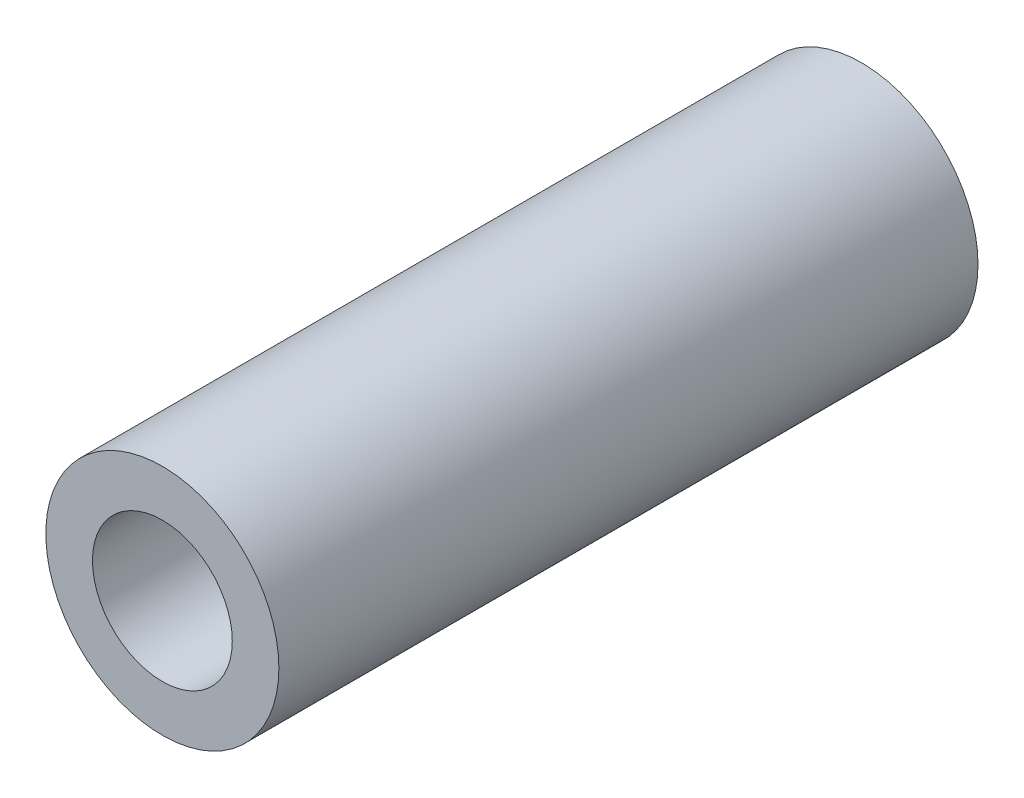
ISO-10303-21;
HEADER;
FILE_DESCRIPTION(('STEP AP214'),'2;1');
FILE_NAME('part.step','',(''),(''),'','','');
FILE_SCHEMA(('AUTOMOTIVE_DESIGN { 1 0 10303 214 1 1 1 1 }'));
ENDSEC;
DATA;
#1=APPLICATION_CONTEXT('core data for automotive mechanical design processes');
#2=APPLICATION_PROTOCOL_DEFINITION('international standard','automotive_design',2000,#1);
#3=PRODUCT_CONTEXT('',#1,'mechanical');
#4=PRODUCT('Part','Part','',(#3));
#5=PRODUCT_RELATED_PRODUCT_CATEGORY('part','',(#4));
#6=PRODUCT_DEFINITION_FORMATION('','',#4);
#7=PRODUCT_DEFINITION_CONTEXT('part definition',#1,'design');
#8=PRODUCT_DEFINITION('design','',#6,#7);
#9=PRODUCT_DEFINITION_SHAPE('','',#8);
#10=(LENGTH_UNIT() NAMED_UNIT(*) SI_UNIT(.MILLI.,.METRE.));
#11=(NAMED_UNIT(*) PLANE_ANGLE_UNIT() SI_UNIT($,.RADIAN.));
#12=(NAMED_UNIT(*) SI_UNIT($,.STERADIAN.) SOLID_ANGLE_UNIT());
#13=UNCERTAINTY_MEASURE_WITH_UNIT(LENGTH_MEASURE(1.E-05),#10,'distance_accuracy_value','');
#14=(GEOMETRIC_REPRESENTATION_CONTEXT(3) GLOBAL_UNCERTAINTY_ASSIGNED_CONTEXT((#13)) GLOBAL_UNIT_ASSIGNED_CONTEXT((#10,
#11,#12)) REPRESENTATION_CONTEXT('',''));
#15=CARTESIAN_POINT('',(0.,0.,0.));
#16=DIRECTION('',(0.,0.,1.));
#17=DIRECTION('',(1.,0.,0.));
#18=AXIS2_PLACEMENT_3D('',#15,#16,#17);
#19=CARTESIAN_POINT('',(0.,0.,150.));
#20=DIRECTION('',(0.,0.,-1.));
#21=DIRECTION('',(-1.,0.,0.));
#22=AXIS2_PLACEMENT_3D('',#19,#20,#21);
#23=CYLINDRICAL_SURFACE('',#22,15.);
#24=CARTESIAN_POINT('',(0.,0.,150.));
#25=DIRECTION('',(0.,0.,1.));
#26=DIRECTION('',(1.,0.,0.));
#27=AXIS2_PLACEMENT_3D('',#24,#25,#26);
#28=CIRCLE('',#27,15.);
#29=CARTESIAN_POINT('',(15.,0.,150.));
#30=VERTEX_POINT('',#29);
#31=EDGE_CURVE('E40',#30,#30,#28,.T.);
#32=ORIENTED_EDGE('',*,*,#31,.T.);
#33=EDGE_LOOP('',(#32));
#34=FACE_BOUND('',#33,.T.);
#35=CARTESIAN_POINT('',(0.,0.,50.));
#36=DIRECTION('',(0.,0.,-1.));
#37=DIRECTION('',(-1.,0.,0.));
#38=AXIS2_PLACEMENT_3D('',#35,#36,#37);
#39=CIRCLE('',#38,15.);
#40=CARTESIAN_POINT('',(-15.,0.,50.));
#41=VERTEX_POINT('',#40);
#42=EDGE_CURVE('E44',#41,#41,#39,.T.);
#43=ORIENTED_EDGE('',*,*,#42,.T.);
#44=EDGE_LOOP('',(#43));
#45=FACE_BOUND('',#44,.T.);
#46=ADVANCED_FACE('F29',(#34,#45),#23,.F.);
#47=CARTESIAN_POINT('',(0.,0.,150.));
#48=DIRECTION('',(0.,0.,1.));
#49=DIRECTION('',(1.,0.,0.));
#50=AXIS2_PLACEMENT_3D('',#47,#48,#49);
#51=PLANE('',#50);
#52=CARTESIAN_POINT('',(0.,0.,150.));
#53=DIRECTION('',(0.,0.,1.));
#54=DIRECTION('',(1.,0.,0.));
#55=AXIS2_PLACEMENT_3D('',#52,#53,#54);
#56=CIRCLE('',#55,25.);
#57=CARTESIAN_POINT('',(25.,0.,150.));
#58=VERTEX_POINT('',#57);
#59=EDGE_CURVE('E10',#58,#58,#56,.T.);
#60=ORIENTED_EDGE('',*,*,#59,.T.);
#61=EDGE_LOOP('',(#60));
#62=FACE_BOUND('',#61,.T.);
#63=ORIENTED_EDGE('',*,*,#31,.F.);
#64=EDGE_LOOP('',(#63));
#65=FACE_BOUND('',#64,.T.);
#66=ADVANCED_FACE('F59',(#62,#65),#51,.T.);
#67=CARTESIAN_POINT('',(0.,0.,0.));
#68=DIRECTION('',(0.,0.,1.));
#69=DIRECTION('',(1.,0.,0.));
#70=AXIS2_PLACEMENT_3D('',#67,#68,#69);
#71=PLANE('',#70);
#72=CARTESIAN_POINT('',(0.,0.,0.));
#73=DIRECTION('',(0.,0.,1.));
#74=DIRECTION('',(1.,0.,0.));
#75=AXIS2_PLACEMENT_3D('',#72,#73,#74);
#76=CIRCLE('',#75,25.);
#77=CARTESIAN_POINT('',(25.,0.,0.));
#78=VERTEX_POINT('',#77);
#79=EDGE_CURVE('E33',#78,#78,#76,.T.);
#80=ORIENTED_EDGE('',*,*,#79,.F.);
#81=EDGE_LOOP('',(#80));
#82=FACE_BOUND('',#81,.T.);
#83=ADVANCED_FACE('F55',(#82),#71,.F.);
#84=CARTESIAN_POINT('',(0.,0.,150.));
#85=DIRECTION('',(0.,0.,-1.));
#86=DIRECTION('',(-1.,0.,0.));
#87=AXIS2_PLACEMENT_3D('',#84,#85,#86);
#88=CYLINDRICAL_SURFACE('',#87,25.);
#89=ORIENTED_EDGE('',*,*,#59,.F.);
#90=EDGE_LOOP('',(#89));
#91=FACE_BOUND('',#90,.T.);
#92=ORIENTED_EDGE('',*,*,#79,.T.);
#93=EDGE_LOOP('',(#92));
#94=FACE_BOUND('',#93,.T.);
#95=ADVANCED_FACE('F31',(#91,#94),#88,.T.);
#96=CARTESIAN_POINT('',(0.,0.,50.));
#97=DIRECTION('',(0.,0.,-1.));
#98=DIRECTION('',(-1.,0.,0.));
#99=AXIS2_PLACEMENT_3D('',#96,#97,#98);
#100=PLANE('',#99);
#101=ORIENTED_EDGE('',*,*,#42,.F.);
#102=EDGE_LOOP('',(#101));
#103=FACE_BOUND('',#102,.T.);
#104=ADVANCED_FACE('F49',(#103),#100,.F.);
#105=CLOSED_SHELL('',(#46,#66,#83,#95,#104));
#106=MANIFOLD_SOLID_BREP('B2',#105);
#107=ADVANCED_BREP_SHAPE_REPRESENTATION('',(#18,#106),#14);
#108=SHAPE_DEFINITION_REPRESENTATION(#9,#107);
ENDSEC;
END-ISO-10303-21;
